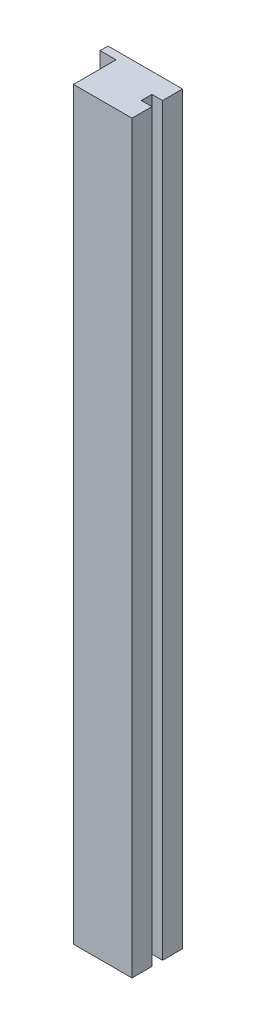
ISO-10303-21;
HEADER;
FILE_DESCRIPTION(('STEP AP214'),'2;1');
FILE_NAME('part.step','',(''),(''),'','','');
FILE_SCHEMA(('AUTOMOTIVE_DESIGN { 1 0 10303 214 1 1 1 1 }'));
ENDSEC;
DATA;
#1=APPLICATION_CONTEXT('core data for automotive mechanical design processes');
#2=APPLICATION_PROTOCOL_DEFINITION('international standard','automotive_design',2000,#1);
#3=PRODUCT_CONTEXT('',#1,'mechanical');
#4=PRODUCT('Part','Part','',(#3));
#5=PRODUCT_RELATED_PRODUCT_CATEGORY('part','',(#4));
#6=PRODUCT_DEFINITION_FORMATION('','',#4);
#7=PRODUCT_DEFINITION_CONTEXT('part definition',#1,'design');
#8=PRODUCT_DEFINITION('design','',#6,#7);
#9=PRODUCT_DEFINITION_SHAPE('','',#8);
#10=(LENGTH_UNIT() NAMED_UNIT(*) SI_UNIT(.MILLI.,.METRE.));
#11=(NAMED_UNIT(*) PLANE_ANGLE_UNIT() SI_UNIT($,.RADIAN.));
#12=(NAMED_UNIT(*) SI_UNIT($,.STERADIAN.) SOLID_ANGLE_UNIT());
#13=UNCERTAINTY_MEASURE_WITH_UNIT(LENGTH_MEASURE(1.E-05),#10,'distance_accuracy_value','');
#14=(GEOMETRIC_REPRESENTATION_CONTEXT(3) GLOBAL_UNCERTAINTY_ASSIGNED_CONTEXT((#13)) GLOBAL_UNIT_ASSIGNED_CONTEXT((#10,
#11,#12)) REPRESENTATION_CONTEXT('',''));
#15=CARTESIAN_POINT('',(0.,0.,0.));
#16=DIRECTION('',(0.,0.,1.));
#17=DIRECTION('',(1.,0.,0.));
#18=AXIS2_PLACEMENT_3D('',#15,#16,#17);
#19=CARTESIAN_POINT('',(3.01606203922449,98.,-2.95289053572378));
#20=DIRECTION('',(1.,0.,0.));
#21=DIRECTION('',(0.,0.,-1.));
#22=AXIS2_PLACEMENT_3D('',#19,#20,#21);
#23=PLANE('',#22);
#24=DIRECTION('',(0.,0.,1.));
#25=VECTOR('',#24,1.);
#26=CARTESIAN_POINT('',(3.01606203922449,42.,-2.95289053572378));
#27=LINE('',#26,#25);
#28=CARTESIAN_POINT('',(3.01606203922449,42.,-6.15289053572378));
#29=VERTEX_POINT('',#28);
#30=CARTESIAN_POINT('',(3.01606203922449,42.,-2.95289053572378));
#31=VERTEX_POINT('',#30);
#32=EDGE_CURVE('E112',#29,#31,#27,.T.);
#33=ORIENTED_EDGE('',*,*,#32,.T.);
#34=DIRECTION('',(0.,-1.,0.));
#35=VECTOR('',#34,1.);
#36=CARTESIAN_POINT('',(3.01606203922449,98.,-2.95289053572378));
#37=LINE('',#36,#35);
#38=CARTESIAN_POINT('',(3.01606203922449,98.,-2.95289053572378));
#39=VERTEX_POINT('',#38);
#40=EDGE_CURVE('E11',#39,#31,#37,.T.);
#41=ORIENTED_EDGE('',*,*,#40,.F.);
#42=DIRECTION('',(0.,0.,1.));
#43=VECTOR('',#42,1.);
#44=CARTESIAN_POINT('',(3.01606203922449,98.,-2.95289053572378));
#45=LINE('',#44,#43);
#46=CARTESIAN_POINT('',(3.01606203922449,98.,-6.15289053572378));
#47=VERTEX_POINT('',#46);
#48=EDGE_CURVE('E144',#47,#39,#45,.T.);
#49=ORIENTED_EDGE('',*,*,#48,.F.);
#50=DIRECTION('',(0.,-1.,0.));
#51=VECTOR('',#50,1.);
#52=CARTESIAN_POINT('',(3.01606203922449,98.,-6.15289053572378));
#53=LINE('',#52,#51);
#54=EDGE_CURVE('E125',#47,#29,#53,.T.);
#55=ORIENTED_EDGE('',*,*,#54,.T.);
#56=EDGE_LOOP('',(#33,#41,#49,#55));
#57=FACE_BOUND('',#56,.T.);
#58=ADVANCED_FACE('F32',(#57),#23,.F.);
#59=CARTESIAN_POINT('',(3.01606203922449,98.,-2.95289053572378));
#60=DIRECTION('',(0.,0.,-1.));
#61=DIRECTION('',(-1.,0.,0.));
#62=AXIS2_PLACEMENT_3D('',#59,#60,#61);
#63=PLANE('',#62);
#64=DIRECTION('',(1.,0.,0.));
#65=VECTOR('',#64,1.);
#66=CARTESIAN_POINT('',(3.01606203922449,42.,-2.95289053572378));
#67=LINE('',#66,#65);
#68=CARTESIAN_POINT('',(7.41462719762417,42.,-2.95289053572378));
#69=VERTEX_POINT('',#68);
#70=EDGE_CURVE('E108',#31,#69,#67,.T.);
#71=ORIENTED_EDGE('',*,*,#70,.T.);
#72=DIRECTION('',(0.,-1.,0.));
#73=VECTOR('',#72,1.);
#74=CARTESIAN_POINT('',(7.41462719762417,98.,-2.95289053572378));
#75=LINE('',#74,#73);
#76=CARTESIAN_POINT('',(7.41462719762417,98.,-2.95289053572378));
#77=VERTEX_POINT('',#76);
#78=EDGE_CURVE('E39',#77,#69,#75,.T.);
#79=ORIENTED_EDGE('',*,*,#78,.F.);
#80=DIRECTION('',(1.,0.,0.));
#81=VECTOR('',#80,1.);
#82=CARTESIAN_POINT('',(3.01606203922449,98.,-2.95289053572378));
#83=LINE('',#82,#81);
#84=EDGE_CURVE('E121',#39,#77,#83,.T.);
#85=ORIENTED_EDGE('',*,*,#84,.F.);
#86=ORIENTED_EDGE('',*,*,#40,.T.);
#87=EDGE_LOOP('',(#71,#79,#85,#86));
#88=FACE_BOUND('',#87,.T.);
#89=ADVANCED_FACE('F120',(#88),#63,.F.);
#90=CARTESIAN_POINT('',(7.41462719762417,98.,-4.45289053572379));
#91=DIRECTION('',(-1.,0.,0.));
#92=DIRECTION('',(0.,0.,1.));
#93=AXIS2_PLACEMENT_3D('',#90,#91,#92);
#94=PLANE('',#93);
#95=DIRECTION('',(0.,0.,-1.));
#96=VECTOR('',#95,1.);
#97=CARTESIAN_POINT('',(7.41462719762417,42.,-4.45289053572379));
#98=LINE('',#97,#96);
#99=CARTESIAN_POINT('',(7.41462719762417,42.,-4.45289053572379));
#100=VERTEX_POINT('',#99);
#101=EDGE_CURVE('E114',#69,#100,#98,.T.);
#102=ORIENTED_EDGE('',*,*,#101,.T.);
#103=DIRECTION('',(0.,-1.,0.));
#104=VECTOR('',#103,1.);
#105=CARTESIAN_POINT('',(7.41462719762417,98.,-4.45289053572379));
#106=LINE('',#105,#104);
#107=CARTESIAN_POINT('',(7.41462719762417,98.,-4.45289053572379));
#108=VERTEX_POINT('',#107);
#109=EDGE_CURVE('E180',#108,#100,#106,.T.);
#110=ORIENTED_EDGE('',*,*,#109,.F.);
#111=DIRECTION('',(0.,0.,-1.));
#112=VECTOR('',#111,1.);
#113=CARTESIAN_POINT('',(7.41462719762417,98.,-4.45289053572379));
#114=LINE('',#113,#112);
#115=EDGE_CURVE('E147',#77,#108,#114,.T.);
#116=ORIENTED_EDGE('',*,*,#115,.F.);
#117=ORIENTED_EDGE('',*,*,#78,.T.);
#118=EDGE_LOOP('',(#102,#110,#116,#117));
#119=FACE_BOUND('',#118,.T.);
#120=ADVANCED_FACE('F184',(#119),#94,.F.);
#121=CARTESIAN_POINT('',(7.41462719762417,98.,-4.45289053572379));
#122=DIRECTION('',(0.,0.,1.));
#123=DIRECTION('',(1.,0.,0.));
#124=AXIS2_PLACEMENT_3D('',#121,#122,#123);
#125=PLANE('',#124);
#126=DIRECTION('',(-1.,0.,0.));
#127=VECTOR('',#126,1.);
#128=CARTESIAN_POINT('',(7.41462719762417,42.,-4.45289053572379));
#129=LINE('',#128,#127);
#130=CARTESIAN_POINT('',(6.61462719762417,42.,-4.45289053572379));
#131=VERTEX_POINT('',#130);
#132=EDGE_CURVE('E129',#100,#131,#129,.T.);
#133=ORIENTED_EDGE('',*,*,#132,.T.);
#134=DIRECTION('',(0.,-1.,0.));
#135=VECTOR('',#134,1.);
#136=CARTESIAN_POINT('',(6.61462719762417,98.,-4.45289053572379));
#137=LINE('',#136,#135);
#138=CARTESIAN_POINT('',(6.61462719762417,98.,-4.45289053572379));
#139=VERTEX_POINT('',#138);
#140=EDGE_CURVE('E177',#139,#131,#137,.T.);
#141=ORIENTED_EDGE('',*,*,#140,.F.);
#142=DIRECTION('',(-1.,0.,0.));
#143=VECTOR('',#142,1.);
#144=CARTESIAN_POINT('',(7.41462719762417,98.,-4.45289053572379));
#145=LINE('',#144,#143);
#146=EDGE_CURVE('E149',#108,#139,#145,.T.);
#147=ORIENTED_EDGE('',*,*,#146,.F.);
#148=ORIENTED_EDGE('',*,*,#109,.T.);
#149=EDGE_LOOP('',(#133,#141,#147,#148));
#150=FACE_BOUND('',#149,.T.);
#151=ADVANCED_FACE('F192',(#150),#125,.F.);
#152=CARTESIAN_POINT('',(6.61462719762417,98.,-5.25289053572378));
#153=DIRECTION('',(-1.,0.,0.));
#154=DIRECTION('',(0.,0.,1.));
#155=AXIS2_PLACEMENT_3D('',#152,#153,#154);
#156=PLANE('',#155);
#157=DIRECTION('',(0.,0.,-1.));
#158=VECTOR('',#157,1.);
#159=CARTESIAN_POINT('',(6.61462719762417,42.,-5.25289053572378));
#160=LINE('',#159,#158);
#161=CARTESIAN_POINT('',(6.61462719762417,42.,-5.25289053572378));
#162=VERTEX_POINT('',#161);
#163=EDGE_CURVE('E131',#131,#162,#160,.T.);
#164=ORIENTED_EDGE('',*,*,#163,.T.);
#165=DIRECTION('',(0.,-1.,0.));
#166=VECTOR('',#165,1.);
#167=CARTESIAN_POINT('',(6.61462719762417,98.,-5.25289053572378));
#168=LINE('',#167,#166);
#169=CARTESIAN_POINT('',(6.61462719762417,98.,-5.25289053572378));
#170=VERTEX_POINT('',#169);
#171=EDGE_CURVE('E174',#170,#162,#168,.T.);
#172=ORIENTED_EDGE('',*,*,#171,.F.);
#173=DIRECTION('',(0.,0.,-1.));
#174=VECTOR('',#173,1.);
#175=CARTESIAN_POINT('',(6.61462719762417,98.,-5.25289053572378));
#176=LINE('',#175,#174);
#177=EDGE_CURVE('E151',#139,#170,#176,.T.);
#178=ORIENTED_EDGE('',*,*,#177,.F.);
#179=ORIENTED_EDGE('',*,*,#140,.T.);
#180=EDGE_LOOP('',(#164,#172,#178,#179));
#181=FACE_BOUND('',#180,.T.);
#182=ADVANCED_FACE('F195',(#181),#156,.F.);
#183=CARTESIAN_POINT('',(7.41462719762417,98.,-5.25289053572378));
#184=DIRECTION('',(0.,0.,-1.));
#185=DIRECTION('',(-1.,0.,0.));
#186=AXIS2_PLACEMENT_3D('',#183,#184,#185);
#187=PLANE('',#186);
#188=DIRECTION('',(1.,0.,0.));
#189=VECTOR('',#188,1.);
#190=CARTESIAN_POINT('',(7.41462719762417,42.,-5.25289053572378));
#191=LINE('',#190,#189);
#192=CARTESIAN_POINT('',(7.41462719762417,42.,-5.25289053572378));
#193=VERTEX_POINT('',#192);
#194=EDGE_CURVE('E133',#162,#193,#191,.T.);
#195=ORIENTED_EDGE('',*,*,#194,.T.);
#196=DIRECTION('',(0.,-1.,0.));
#197=VECTOR('',#196,1.);
#198=CARTESIAN_POINT('',(7.41462719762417,98.,-5.25289053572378));
#199=LINE('',#198,#197);
#200=CARTESIAN_POINT('',(7.41462719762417,98.,-5.25289053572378));
#201=VERTEX_POINT('',#200);
#202=EDGE_CURVE('E171',#201,#193,#199,.T.);
#203=ORIENTED_EDGE('',*,*,#202,.F.);
#204=DIRECTION('',(1.,0.,0.));
#205=VECTOR('',#204,1.);
#206=CARTESIAN_POINT('',(7.41462719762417,98.,-5.25289053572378));
#207=LINE('',#206,#205);
#208=EDGE_CURVE('E153',#170,#201,#207,.T.);
#209=ORIENTED_EDGE('',*,*,#208,.F.);
#210=ORIENTED_EDGE('',*,*,#171,.T.);
#211=EDGE_LOOP('',(#195,#203,#209,#210));
#212=FACE_BOUND('',#211,.T.);
#213=ADVANCED_FACE('F200',(#212),#187,.F.);
#214=CARTESIAN_POINT('',(7.41462719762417,98.,-6.75289053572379));
#215=DIRECTION('',(-1.,0.,0.));
#216=DIRECTION('',(0.,0.,1.));
#217=AXIS2_PLACEMENT_3D('',#214,#215,#216);
#218=PLANE('',#217);
#219=DIRECTION('',(0.,0.,-1.));
#220=VECTOR('',#219,1.);
#221=CARTESIAN_POINT('',(7.41462719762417,42.,-6.75289053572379));
#222=LINE('',#221,#220);
#223=CARTESIAN_POINT('',(7.41462719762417,42.,-6.75289053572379));
#224=VERTEX_POINT('',#223);
#225=EDGE_CURVE('E135',#193,#224,#222,.T.);
#226=ORIENTED_EDGE('',*,*,#225,.T.);
#227=DIRECTION('',(0.,-1.,0.));
#228=VECTOR('',#227,1.);
#229=CARTESIAN_POINT('',(7.41462719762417,98.,-6.75289053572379));
#230=LINE('',#229,#228);
#231=CARTESIAN_POINT('',(7.41462719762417,98.,-6.75289053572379));
#232=VERTEX_POINT('',#231);
#233=EDGE_CURVE('E168',#232,#224,#230,.T.);
#234=ORIENTED_EDGE('',*,*,#233,.F.);
#235=DIRECTION('',(0.,0.,-1.));
#236=VECTOR('',#235,1.);
#237=CARTESIAN_POINT('',(7.41462719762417,98.,-6.75289053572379));
#238=LINE('',#237,#236);
#239=EDGE_CURVE('E155',#201,#232,#238,.T.);
#240=ORIENTED_EDGE('',*,*,#239,.F.);
#241=ORIENTED_EDGE('',*,*,#202,.T.);
#242=EDGE_LOOP('',(#226,#234,#240,#241));
#243=FACE_BOUND('',#242,.T.);
#244=ADVANCED_FACE('F206',(#243),#218,.F.);
#245=CARTESIAN_POINT('',(3.09180856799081,98.,-6.75289053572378));
#246=DIRECTION('',(0.,0.,1.));
#247=DIRECTION('',(1.,0.,0.));
#248=AXIS2_PLACEMENT_3D('',#245,#246,#247);
#249=PLANE('',#248);
#250=DIRECTION('',(-1.,0.,0.));
#251=VECTOR('',#250,1.);
#252=CARTESIAN_POINT('',(3.09180856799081,42.,-6.75289053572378));
#253=LINE('',#252,#251);
#254=CARTESIAN_POINT('',(1.81606203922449,42.,-6.75289053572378));
#255=VERTEX_POINT('',#254);
#256=EDGE_CURVE('E138',#224,#255,#253,.T.);
#257=ORIENTED_EDGE('',*,*,#256,.T.);
#258=DIRECTION('',(0.,-1.,0.));
#259=VECTOR('',#258,1.);
#260=CARTESIAN_POINT('',(1.81606203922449,98.,-6.75289053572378));
#261=LINE('',#260,#259);
#262=CARTESIAN_POINT('',(1.81606203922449,98.,-6.75289053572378));
#263=VERTEX_POINT('',#262);
#264=EDGE_CURVE('E165',#263,#255,#261,.T.);
#265=ORIENTED_EDGE('',*,*,#264,.F.);
#266=DIRECTION('',(-1.,0.,0.));
#267=VECTOR('',#266,1.);
#268=CARTESIAN_POINT('',(3.09180856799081,98.,-6.75289053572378));
#269=LINE('',#268,#267);
#270=EDGE_CURVE('E157',#232,#263,#269,.T.);
#271=ORIENTED_EDGE('',*,*,#270,.F.);
#272=ORIENTED_EDGE('',*,*,#233,.T.);
#273=EDGE_LOOP('',(#257,#265,#271,#272));
#274=FACE_BOUND('',#273,.T.);
#275=ADVANCED_FACE('F209',(#274),#249,.F.);
#276=CARTESIAN_POINT('',(1.81606203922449,98.,-6.75289053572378));
#277=DIRECTION('',(1.,0.,0.));
#278=DIRECTION('',(0.,0.,-1.));
#279=AXIS2_PLACEMENT_3D('',#276,#277,#278);
#280=PLANE('',#279);
#281=DIRECTION('',(0.,0.,1.));
#282=VECTOR('',#281,1.);
#283=CARTESIAN_POINT('',(1.81606203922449,42.,-6.75289053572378));
#284=LINE('',#283,#282);
#285=CARTESIAN_POINT('',(1.81606203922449,42.,-6.15289053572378));
#286=VERTEX_POINT('',#285);
#287=EDGE_CURVE('E140',#255,#286,#284,.T.);
#288=ORIENTED_EDGE('',*,*,#287,.T.);
#289=DIRECTION('',(0.,-1.,0.));
#290=VECTOR('',#289,1.);
#291=CARTESIAN_POINT('',(1.81606203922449,98.,-6.15289053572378));
#292=LINE('',#291,#290);
#293=CARTESIAN_POINT('',(1.81606203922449,98.,-6.15289053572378));
#294=VERTEX_POINT('',#293);
#295=EDGE_CURVE('E162',#294,#286,#292,.T.);
#296=ORIENTED_EDGE('',*,*,#295,.F.);
#297=DIRECTION('',(0.,0.,1.));
#298=VECTOR('',#297,1.);
#299=CARTESIAN_POINT('',(1.81606203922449,98.,-6.75289053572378));
#300=LINE('',#299,#298);
#301=EDGE_CURVE('E51',#263,#294,#300,.T.);
#302=ORIENTED_EDGE('',*,*,#301,.F.);
#303=ORIENTED_EDGE('',*,*,#264,.T.);
#304=EDGE_LOOP('',(#288,#296,#302,#303));
#305=FACE_BOUND('',#304,.T.);
#306=ADVANCED_FACE('F212',(#305),#280,.F.);
#307=CARTESIAN_POINT('',(1.81606203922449,98.,-6.15289053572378));
#308=DIRECTION('',(0.,0.,-1.));
#309=DIRECTION('',(-1.,0.,0.));
#310=AXIS2_PLACEMENT_3D('',#307,#308,#309);
#311=PLANE('',#310);
#312=DIRECTION('',(1.,0.,0.));
#313=VECTOR('',#312,1.);
#314=CARTESIAN_POINT('',(1.81606203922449,42.,-6.15289053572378));
#315=LINE('',#314,#313);
#316=EDGE_CURVE('E142',#286,#29,#315,.T.);
#317=ORIENTED_EDGE('',*,*,#316,.T.);
#318=ORIENTED_EDGE('',*,*,#54,.F.);
#319=DIRECTION('',(1.,0.,0.));
#320=VECTOR('',#319,1.);
#321=CARTESIAN_POINT('',(1.81606203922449,98.,-6.15289053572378));
#322=LINE('',#321,#320);
#323=EDGE_CURVE('E46',#294,#47,#322,.T.);
#324=ORIENTED_EDGE('',*,*,#323,.F.);
#325=ORIENTED_EDGE('',*,*,#295,.T.);
#326=EDGE_LOOP('',(#317,#318,#324,#325));
#327=FACE_BOUND('',#326,.T.);
#328=ADVANCED_FACE('F214',(#327),#311,.F.);
#329=CARTESIAN_POINT('',(3.01606203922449,98.,-5.25289053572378));
#330=DIRECTION('',(0.,1.,0.));
#331=DIRECTION('',(0.,0.,1.));
#332=AXIS2_PLACEMENT_3D('',#329,#330,#331);
#333=PLANE('',#332);
#334=ORIENTED_EDGE('',*,*,#48,.T.);
#335=ORIENTED_EDGE('',*,*,#84,.T.);
#336=ORIENTED_EDGE('',*,*,#115,.T.);
#337=ORIENTED_EDGE('',*,*,#146,.T.);
#338=ORIENTED_EDGE('',*,*,#177,.T.);
#339=ORIENTED_EDGE('',*,*,#208,.T.);
#340=ORIENTED_EDGE('',*,*,#239,.T.);
#341=ORIENTED_EDGE('',*,*,#270,.T.);
#342=ORIENTED_EDGE('',*,*,#301,.T.);
#343=ORIENTED_EDGE('',*,*,#323,.T.);
#344=EDGE_LOOP('',(#334,#335,#336,#337,#338,#339,#340,#341,#342,#343));
#345=FACE_BOUND('',#344,.T.);
#346=ADVANCED_FACE('F187',(#345),#333,.T.);
#347=CARTESIAN_POINT('',(3.01606203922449,42.,-5.25289053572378));
#348=DIRECTION('',(0.,1.,0.));
#349=DIRECTION('',(0.,0.,1.));
#350=AXIS2_PLACEMENT_3D('',#347,#348,#349);
#351=PLANE('',#350);
#352=ORIENTED_EDGE('',*,*,#32,.F.);
#353=ORIENTED_EDGE('',*,*,#316,.F.);
#354=ORIENTED_EDGE('',*,*,#287,.F.);
#355=ORIENTED_EDGE('',*,*,#256,.F.);
#356=ORIENTED_EDGE('',*,*,#225,.F.);
#357=ORIENTED_EDGE('',*,*,#194,.F.);
#358=ORIENTED_EDGE('',*,*,#163,.F.);
#359=ORIENTED_EDGE('',*,*,#132,.F.);
#360=ORIENTED_EDGE('',*,*,#101,.F.);
#361=ORIENTED_EDGE('',*,*,#70,.F.);
#362=EDGE_LOOP('',(#352,#353,#354,#355,#356,#357,#358,#359,#360,#361));
#363=FACE_BOUND('',#362,.T.);
#364=ADVANCED_FACE('F109',(#363),#351,.F.);
#365=CLOSED_SHELL('',(#58,#89,#120,#151,#182,#213,#244,#275,#306,#328,#346,#364));
#366=MANIFOLD_SOLID_BREP('B2',#365);
#367=ADVANCED_BREP_SHAPE_REPRESENTATION('',(#18,#366),#14);
#368=SHAPE_DEFINITION_REPRESENTATION(#9,#367);
ENDSEC;
END-ISO-10303-21;
